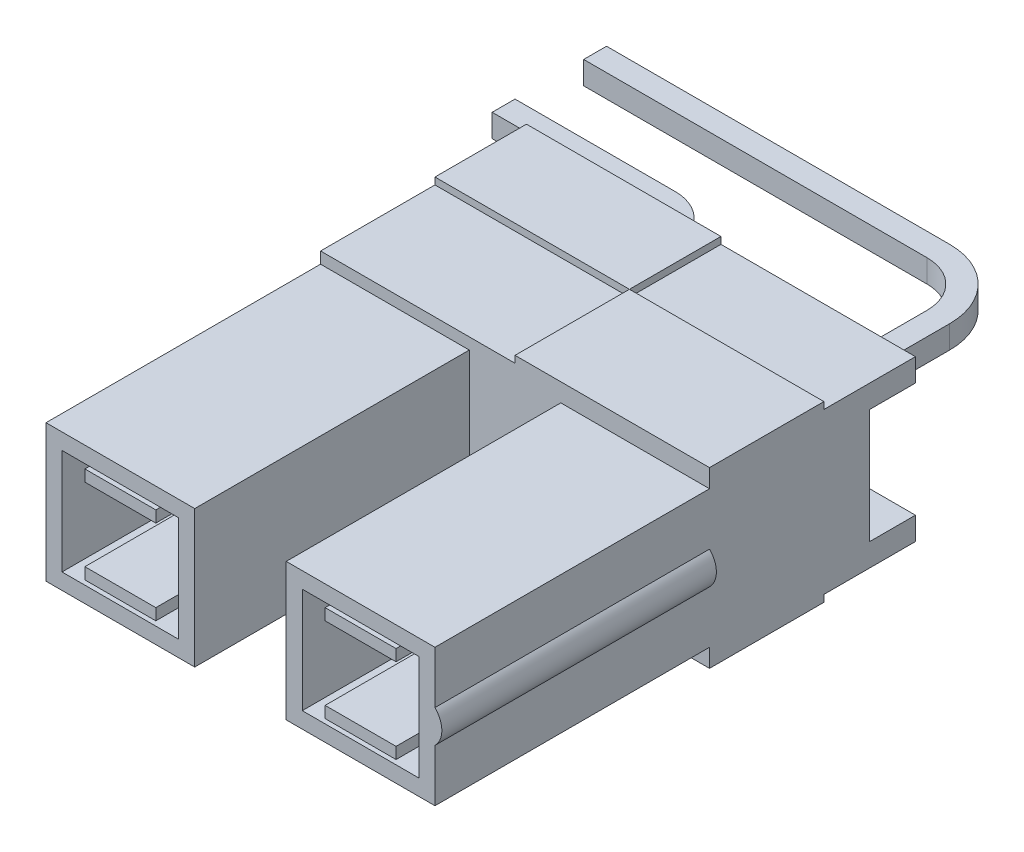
from build123d import *

# Parameters (mm, degrees)
ESQUISSE1_W             = 3.25
ESQUISSE1_H             = 3
ESQUISSE1_W_2           = 2.55
ESQUISSE1_H_2           = 2.3
EXTRUSION1_DEPTH        = 6
EXTRUSION1_2_DEPTH      = 6
ESQUISSE2_W             = 8.5
ESQUISSE2_H             = 3.5
EXTRUSION2_DEPTH        = 4.5
ESQUISSE3_W             = 1.275343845
ESQUISSE3_H             = 2.5
ENL_V_MAT_EXTRU_1_DEPTH = 11.550473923
EXTRUSION3_DEPTH        = 6
EXTRUSION4_DEPTH        = 0.5
EXTRUSION5_DEPTH        = 0.15
ESQUISSE9_W             = 1.55
ESQUISSE9_H             = 0.25
EXTRUSION9_DEPTH        = 6
ESQUISSE10_W            = 0.5
ESQUISSE10_H            = 0.5
EXTRUSION10_DEPTH       = 5
ESQUISSE11_W            = 0.5
ESQUISSE11_H            = 0.5
ENL_V_MAT_EXTRU_2_DEPTH = 2
ESQUISSE12_W            = 0.5
ESQUISSE12_H            = 0.5
EXTRUSION11_DEPTH       = 4
CONG_1_R                = 0.5
CONG_2_R                = 1
ESQUISSE13_W            = 0.5
ESQUISSE13_H            = 0.5
EXTRUSION12_DEPTH       = 8.5
CONG_3_R                = 1.5
CONG_4_R                = 1


with BuildPart() as part:
    # Esquisse1 → Extrusion1 (new body)
    with BuildSketch(Plane.XY):
        with Locations((-2.625, 0)):
            Rectangle(ESQUISSE1_W, ESQUISSE1_H)
        with Locations((-2.625, 0)):
            Rectangle(ESQUISSE1_W_2, ESQUISSE1_H_2, mode=Mode.SUBTRACT)
    extrude(amount=EXTRUSION1_DEPTH)



with BuildPart() as body_2:
    # Esquisse1 → Extrusion1 2 (new body)
    with BuildSketch(Plane.XY):
        with Locations((2.625, 0)):
            Rectangle(ESQUISSE1_W, ESQUISSE1_H)
        with Locations((2.625, 0)):
            Rectangle(ESQUISSE1_W_2, ESQUISSE1_H_2, mode=Mode.SUBTRACT)
    extrude(amount=EXTRUSION1_2_DEPTH)


with BuildPart() as part_1:
    add(part.part)

    add(body_2.part)  # Extrusion2 merges body 2
    # Esquisse2 → Extrusion2 (add)
    with BuildSketch(Plane(origin=(0, 0, 0), x_dir=(-1, 0, 0), z_dir=(0, 0, -1))):
        Rectangle(ESQUISSE2_W, ESQUISSE2_H)
    extrude(amount=EXTRUSION2_DEPTH)

    # Esquisse3 → Enl_v. mat.-Extru.1 (cut, through all)
    with BuildSketch(Plane(origin=(4.25, 0, 0), x_dir=(0, 0, -1), z_dir=(1, 0, 0))):
        with Locations((4.137671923, 0)):
            Rectangle(ESQUISSE3_W, ESQUISSE3_H)
    extrude(amount=-ENL_V_MAT_EXTRU_1_DEPTH, mode=Mode.SUBTRACT)

    # Esquisse5 → Extrusion3 (add)
    with BuildSketch(Plane.XY.offset(6)):
        with BuildLine():
            Line((4.25, -0.357071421), (4.25, 0.357071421))
            ThreePointArc((4.25, 0.357071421), (4.4, 0), (4.25, -0.357071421))
        make_face()
    extrude(amount=-EXTRUSION3_DEPTH)

    # Esquisse6 → Extrusion4 (add)
    with BuildSketch(Plane.ZY.offset(4.25)):
        with BuildLine():
            Line((-0.2, 0.25), (0.2, 0.25))
            ThreePointArc((0.2, 0.25), (0.45, 0), (0.2, -0.25))
            Line((0.2, -0.25), (-0.2, -0.25))
            ThreePointArc((-0.2, -0.25), (-0.45, 0), (-0.2, 0.25))
        make_face()
    extrude(amount=EXTRUSION4_DEPTH)

    # Esquisse7 → Extrusion5 (add)
    with BuildSketch(Plane(origin=(0, 1.75, 0), x_dir=(-1, 0, 0), z_dir=(0, 1, 0))):
        with BuildLine():
            Line((4.25, -4.5), (0, -4.5))
            Line((0, -4.5), (0, -2.510102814))
            ThreePointArc((0, -2.510102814), (-0.007143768, -2.507143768), (-0.010102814, -2.5))
            Line((-0.010102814, -2.5), (-4.25, -2.5))
            Line((-4.25, -2.5), (-4.25, 0))
            Line((-4.25, 0), (0, 0))
            Line((0, 0), (0, -2.489897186))
            ThreePointArc((0, -2.489897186), (0.007143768, -2.492856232), (0.010102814, -2.5))
            Line((0.010102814, -2.5), (4.25, -2.5))
            Line((4.25, -2.5), (4.25, -4.5))
        make_face()
    extrusion5 = extrude(amount=EXTRUSION5_DEPTH)

    # Sym_trie1: Extrusion5 across plane
    add(extrusion5.mirror(Plane.ZX))

    # Esquisse9 → Extrusion9 (add)
    with BuildSketch(Plane.XY):
        with Locations((-2.625, 0.925)):
            Rectangle(ESQUISSE9_W, ESQUISSE9_H)
        with Locations((2.625, 0.925)):
            Rectangle(ESQUISSE9_W, ESQUISSE9_H)
        with Locations((2.625, -0.925)):
            Rectangle(ESQUISSE9_W, ESQUISSE9_H)
        with Locations((-2.625, -0.925)):
            Rectangle(ESQUISSE9_W, ESQUISSE9_H)
    extrude(amount=EXTRUSION9_DEPTH)

    # Esquisse10 → Extrusion10 (add)
    with BuildSketch(Plane(origin=(0, 0, -3.5), x_dir=(-1, 0, 0), z_dir=(0, 0, -1))):
        with Locations((-2.25, 0)):
            Rectangle(ESQUISSE10_W, ESQUISSE10_H)
        with Locations((2.25, 0)):
            Rectangle(ESQUISSE10_W, ESQUISSE10_H)
    extrude(amount=EXTRUSION10_DEPTH)

    # Esquisse11 → Enl_v. mat.-Extru.2 (cut)
    with BuildSketch(Plane(origin=(0, 0, -8.5), x_dir=(-1, 0, 0), z_dir=(0, 0, -1))):
        with Locations((2.25, 0)):
            Rectangle(ESQUISSE11_W, ESQUISSE11_H)
    extrude(amount=-ENL_V_MAT_EXTRU_2_DEPTH, mode=Mode.SUBTRACT)

    # Esquisse12 → Extrusion11 (add)
    with BuildSketch(Plane.ZY.offset(2.5)):
        with Locations((-6.25, 0)):
            Rectangle(ESQUISSE12_W, ESQUISSE12_H)
    extrude(amount=EXTRUSION11_DEPTH)

    # Cong_1
    cong_1_edges = [part_1.edges().sort_by_distance(p)[0] for p in [
        (-2.5, 0, -6),
    ]]
    fillet(cong_1_edges, radius=CONG_1_R)

    # Cong_2
    cong_2_edges = [part_1.edges().sort_by_distance(p)[0] for p in [
        (-2, 0, -6.5),
    ]]
    fillet(cong_2_edges, radius=CONG_2_R)

    # Esquisse13 → Extrusion12 (add)
    with BuildSketch(Plane.ZY.offset(-2)):
        with Locations((-8.25, 0)):
            Rectangle(ESQUISSE13_W, ESQUISSE13_H)
    extrude(amount=EXTRUSION12_DEPTH)

    # Cong_3
    cong_3_edges = [part_1.edges().sort_by_distance(p)[0] for p in [
        (2.5, 0, -8.5),
    ]]
    fillet(cong_3_edges, radius=CONG_3_R)

    # Cong_4
    cong_4_edges = [part_1.edges().sort_by_distance(p)[0] for p in [
        (2, 0, -8),
    ]]
    fillet(cong_4_edges, radius=CONG_4_R)


solid = part_1.part
